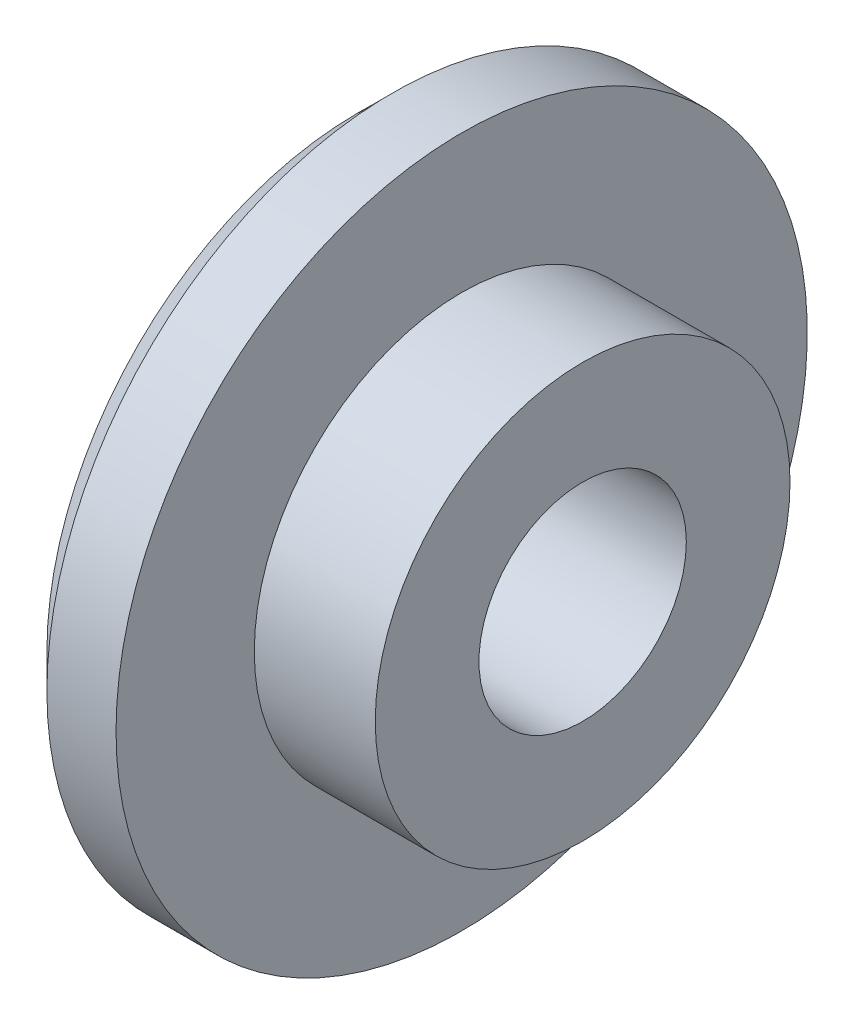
ISO-10303-21;
HEADER;
FILE_DESCRIPTION(('STEP AP214'),'2;1');
FILE_NAME('part.step','',(''),(''),'','','');
FILE_SCHEMA(('AUTOMOTIVE_DESIGN { 1 0 10303 214 1 1 1 1 }'));
ENDSEC;
DATA;
#1=APPLICATION_CONTEXT('core data for automotive mechanical design processes');
#2=APPLICATION_PROTOCOL_DEFINITION('international standard','automotive_design',2000,#1);
#3=PRODUCT_CONTEXT('',#1,'mechanical');
#4=PRODUCT('Part','Part','',(#3));
#5=PRODUCT_RELATED_PRODUCT_CATEGORY('part','',(#4));
#6=PRODUCT_DEFINITION_FORMATION('','',#4);
#7=PRODUCT_DEFINITION_CONTEXT('part definition',#1,'design');
#8=PRODUCT_DEFINITION('design','',#6,#7);
#9=PRODUCT_DEFINITION_SHAPE('','',#8);
#10=(LENGTH_UNIT() NAMED_UNIT(*) SI_UNIT(.MILLI.,.METRE.));
#11=(NAMED_UNIT(*) PLANE_ANGLE_UNIT() SI_UNIT($,.RADIAN.));
#12=(NAMED_UNIT(*) SI_UNIT($,.STERADIAN.) SOLID_ANGLE_UNIT());
#13=UNCERTAINTY_MEASURE_WITH_UNIT(LENGTH_MEASURE(1.E-05),#10,'distance_accuracy_value','');
#14=(GEOMETRIC_REPRESENTATION_CONTEXT(3) GLOBAL_UNCERTAINTY_ASSIGNED_CONTEXT((#13)) GLOBAL_UNIT_ASSIGNED_CONTEXT((#10,
#11,#12)) REPRESENTATION_CONTEXT('',''));
#15=CARTESIAN_POINT('',(0.,0.,0.));
#16=DIRECTION('',(0.,0.,1.));
#17=DIRECTION('',(1.,0.,0.));
#18=AXIS2_PLACEMENT_3D('',#15,#16,#17);
#19=CARTESIAN_POINT('',(0.,0.,-9.99999999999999));
#20=DIRECTION('',(1.,0.,0.));
#21=DIRECTION('',(0.,0.,-1.));
#22=AXIS2_PLACEMENT_3D('',#19,#20,#21);
#23=PLANE('',#22);
#24=CARTESIAN_POINT('',(0.,0.,0.));
#25=DIRECTION('',(1.,0.,0.));
#26=DIRECTION('',(0.,0.,-1.));
#27=AXIS2_PLACEMENT_3D('',#24,#25,#26);
#28=CIRCLE('',#27,8.99999999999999);
#29=CARTESIAN_POINT('',(0.,0.,-8.99999999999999));
#30=VERTEX_POINT('',#29);
#31=EDGE_CURVE('E34',#30,#30,#28,.F.);
#32=ORIENTED_EDGE('',*,*,#31,.T.);
#33=EDGE_LOOP('',(#32));
#34=FACE_BOUND('',#33,.T.);
#35=CARTESIAN_POINT('',(0.,0.,0.));
#36=DIRECTION('',(1.,0.,0.));
#37=DIRECTION('',(0.,0.,-1.));
#38=AXIS2_PLACEMENT_3D('',#35,#36,#37);
#39=CIRCLE('',#38,3.);
#40=CARTESIAN_POINT('',(0.,0.,-3.));
#41=VERTEX_POINT('',#40);
#42=EDGE_CURVE('E50',#41,#41,#39,.T.);
#43=ORIENTED_EDGE('',*,*,#42,.T.);
#44=EDGE_LOOP('',(#43));
#45=FACE_BOUND('',#44,.T.);
#46=ADVANCED_FACE('F28',(#34,#45),#23,.F.);
#47=CARTESIAN_POINT('',(0.,0.,0.));
#48=DIRECTION('',(-1.,0.,0.));
#49=DIRECTION('',(0.,0.,1.));
#50=AXIS2_PLACEMENT_3D('',#47,#48,#49);
#51=CYLINDRICAL_SURFACE('',#50,9.99999999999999);
#52=CARTESIAN_POINT('',(1.,0.,0.));
#53=DIRECTION('',(1.,0.,0.));
#54=DIRECTION('',(0.,0.,-1.));
#55=AXIS2_PLACEMENT_3D('',#52,#53,#54);
#56=CIRCLE('',#55,9.99999999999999);
#57=CARTESIAN_POINT('',(1.,0.,-9.99999999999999));
#58=VERTEX_POINT('',#57);
#59=EDGE_CURVE('E10',#58,#58,#56,.T.);
#60=ORIENTED_EDGE('',*,*,#59,.T.);
#61=EDGE_LOOP('',(#60));
#62=FACE_BOUND('',#61,.T.);
#63=CARTESIAN_POINT('',(3.,0.,0.));
#64=DIRECTION('',(-1.,0.,0.));
#65=DIRECTION('',(0.,0.,1.));
#66=AXIS2_PLACEMENT_3D('',#63,#64,#65);
#67=CIRCLE('',#66,9.99999999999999);
#68=CARTESIAN_POINT('',(3.,0.,9.99999999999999));
#69=VERTEX_POINT('',#68);
#70=EDGE_CURVE('E38',#69,#69,#67,.T.);
#71=ORIENTED_EDGE('',*,*,#70,.T.);
#72=EDGE_LOOP('',(#71));
#73=FACE_BOUND('',#72,.T.);
#74=ADVANCED_FACE('F73',(#62,#73),#51,.T.);
#75=CARTESIAN_POINT('',(3.,0.,-6.));
#76=DIRECTION('',(-1.,0.,0.));
#77=DIRECTION('',(0.,0.,1.));
#78=AXIS2_PLACEMENT_3D('',#75,#76,#77);
#79=PLANE('',#78);
#80=ORIENTED_EDGE('',*,*,#70,.F.);
#81=EDGE_LOOP('',(#80));
#82=FACE_BOUND('',#81,.T.);
#83=CARTESIAN_POINT('',(3.,0.,0.));
#84=DIRECTION('',(-1.,0.,0.));
#85=DIRECTION('',(0.,0.,1.));
#86=AXIS2_PLACEMENT_3D('',#83,#84,#85);
#87=CIRCLE('',#86,6.);
#88=CARTESIAN_POINT('',(3.,0.,6.));
#89=VERTEX_POINT('',#88);
#90=EDGE_CURVE('E42',#89,#89,#87,.T.);
#91=ORIENTED_EDGE('',*,*,#90,.T.);
#92=EDGE_LOOP('',(#91));
#93=FACE_BOUND('',#92,.T.);
#94=ADVANCED_FACE('F67',(#82,#93),#79,.F.);
#95=CARTESIAN_POINT('',(0.,0.,0.));
#96=DIRECTION('',(-1.,0.,0.));
#97=DIRECTION('',(0.,0.,1.));
#98=AXIS2_PLACEMENT_3D('',#95,#96,#97);
#99=CYLINDRICAL_SURFACE('',#98,6.);
#100=ORIENTED_EDGE('',*,*,#90,.F.);
#101=EDGE_LOOP('',(#100));
#102=FACE_BOUND('',#101,.T.);
#103=CARTESIAN_POINT('',(6.5,0.,0.));
#104=DIRECTION('',(-1.,0.,0.));
#105=DIRECTION('',(0.,0.,1.));
#106=AXIS2_PLACEMENT_3D('',#103,#104,#105);
#107=CIRCLE('',#106,6.);
#108=CARTESIAN_POINT('',(6.5,0.,6.));
#109=VERTEX_POINT('',#108);
#110=EDGE_CURVE('E47',#109,#109,#107,.T.);
#111=ORIENTED_EDGE('',*,*,#110,.T.);
#112=EDGE_LOOP('',(#111));
#113=FACE_BOUND('',#112,.T.);
#114=ADVANCED_FACE('F62',(#102,#113),#99,.T.);
#115=CARTESIAN_POINT('',(6.5,0.,0.));
#116=DIRECTION('',(-1.,0.,0.));
#117=DIRECTION('',(0.,0.,1.));
#118=AXIS2_PLACEMENT_3D('',#115,#116,#117);
#119=PLANE('',#118);
#120=CARTESIAN_POINT('',(6.5,0.,0.));
#121=DIRECTION('',(1.,0.,0.));
#122=DIRECTION('',(0.,0.,-1.));
#123=AXIS2_PLACEMENT_3D('',#120,#121,#122);
#124=CIRCLE('',#123,3.);
#125=CARTESIAN_POINT('',(6.5,0.,-3.));
#126=VERTEX_POINT('',#125);
#127=EDGE_CURVE('E53',#126,#126,#124,.T.);
#128=ORIENTED_EDGE('',*,*,#127,.F.);
#129=EDGE_LOOP('',(#128));
#130=FACE_BOUND('',#129,.T.);
#131=ORIENTED_EDGE('',*,*,#110,.F.);
#132=EDGE_LOOP('',(#131));
#133=FACE_BOUND('',#132,.T.);
#134=ADVANCED_FACE('F59',(#130,#133),#119,.F.);
#135=CARTESIAN_POINT('',(0.,0.,0.));
#136=DIRECTION('',(1.,0.,0.));
#137=DIRECTION('',(0.,0.,-1.));
#138=AXIS2_PLACEMENT_3D('',#135,#136,#137);
#139=CYLINDRICAL_SURFACE('',#138,3.);
#140=ORIENTED_EDGE('',*,*,#42,.F.);
#141=EDGE_LOOP('',(#140));
#142=FACE_BOUND('',#141,.T.);
#143=ORIENTED_EDGE('',*,*,#127,.T.);
#144=EDGE_LOOP('',(#143));
#145=FACE_BOUND('',#144,.T.);
#146=ADVANCED_FACE('F57',(#142,#145),#139,.F.);
#147=CARTESIAN_POINT('',(0.,0.,0.));
#148=DIRECTION('',(1.,0.,0.));
#149=DIRECTION('',(0.,0.,-1.));
#150=AXIS2_PLACEMENT_3D('',#147,#148,#149);
#151=CONICAL_SURFACE('',#150,8.99999999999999,0.785398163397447);
#152=ORIENTED_EDGE('',*,*,#59,.F.);
#153=EDGE_LOOP('',(#152));
#154=FACE_BOUND('',#153,.T.);
#155=ORIENTED_EDGE('',*,*,#31,.F.);
#156=EDGE_LOOP('',(#155));
#157=FACE_BOUND('',#156,.T.);
#158=ADVANCED_FACE('F85',(#154,#157),#151,.T.);
#159=CLOSED_SHELL('',(#46,#74,#94,#114,#134,#146,#158));
#160=MANIFOLD_SOLID_BREP('B2',#159);
#161=ADVANCED_BREP_SHAPE_REPRESENTATION('',(#18,#160),#14);
#162=SHAPE_DEFINITION_REPRESENTATION(#9,#161);
ENDSEC;
END-ISO-10303-21;
